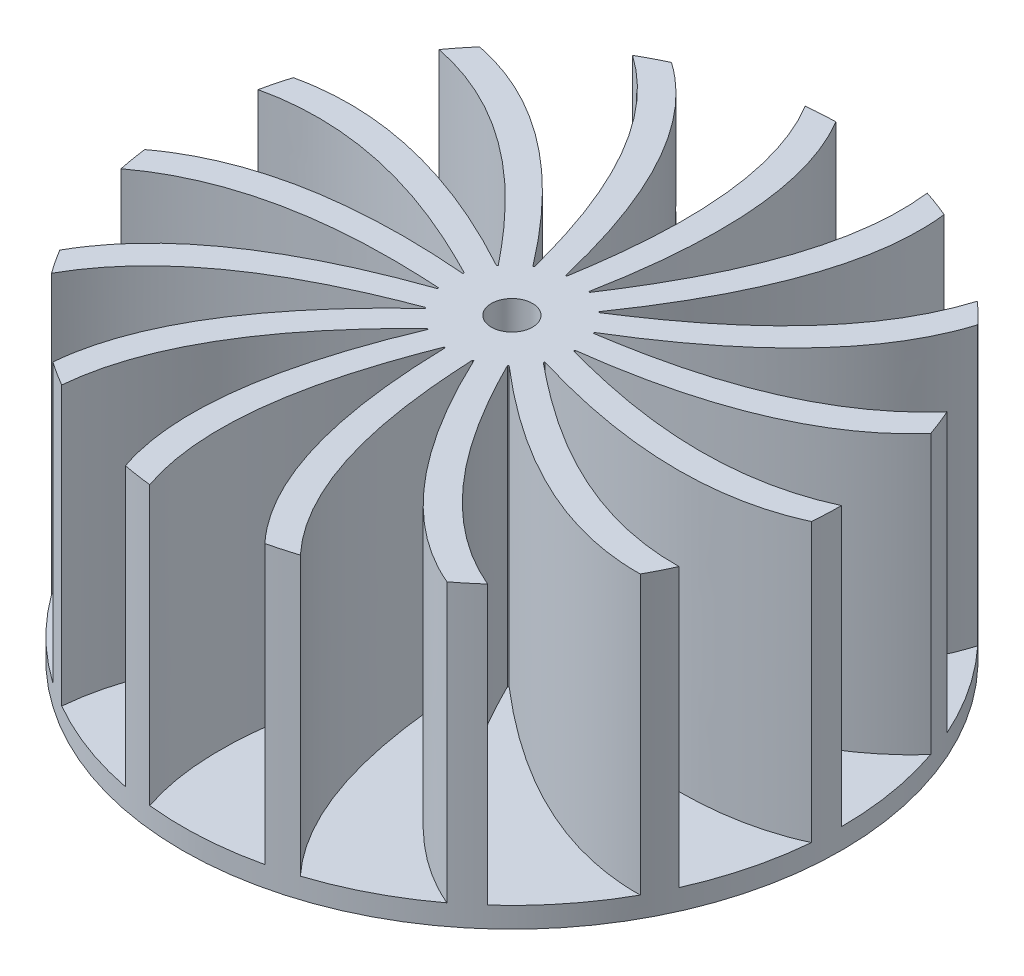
from build123d import *
from build123d.topology import SkipClean

# Parameters (mm, degrees)
SKETCH1_R               = 16
BOSS_EXTRUDE1_DEPTH     = 1
SKETCH2_R               = 3
BOSS_EXTRUDE2_DEPTH     = 13.5
BOSS_EXTRUDE3_DEPTH     = 13.5
CUT_EXTRUDE1_DEPTH      = 27.874709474
CUT_EXTRUDE1_DEPTH_BACK = 27.874709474
SKETCH5_R               = 1


with BuildPart() as part:
    # Sketch1 → Boss-Extrude1 (new body)
    with BuildSketch(Plane(origin=(0, 0, 0), x_dir=(1, 0, 0), z_dir=(0, 1, 0))):
        with Locations(Location((0, 0, 0), (0, 0, 270))):
            Circle(SKETCH1_R)
    extrude(amount=BOSS_EXTRUDE1_DEPTH)

    # Sketch2 → Boss-Extrude2 (add)
    with BuildSketch(Plane(origin=(0, 1, 0), x_dir=(1, 0, 0), z_dir=(0, 1, 0))):
        with Locations(Location((0, 0, 0), (0, 0, 270))):
            Circle(SKETCH2_R)
    extrude(amount=BOSS_EXTRUDE2_DEPTH)

    # Sketch4 → Boss-Extrude3 (add)
    with SkipClean():  # the faces are left unmerged after this step: merging them gives an invalid solid
        with BuildSketch(Plane(origin=(0, 1, 0), x_dir=(1, 0, 0), z_dir=(0, 1, 0))):
            with BuildLine():
                ThreePointArc((16, 0), (15.984664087, -0.70036707), (15.938685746, -1.399391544))
                add(Edge.make_bspline(
                    [(2.764538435, -1.16504388), (11.064438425, -3.664049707), (15.938685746, -1.399391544)],
                    knots=[0, 0, 0, 1, 1, 1], degree=2))
                ThreePointArc((2.764538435, -1.16504388), (2.940545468, -0.59429988), (3, 0))
                add(Edge.make_bspline(
                    [(3, 0), (6.042851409, -0.828316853), (11.492705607, -2.094165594), (16, 0)],
                    knots=[0, 0, 0, 0, 1, 1, 1, 1], degree=3))
            make_face()
            with BuildLine():
                ThreePointArc((2.051665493, -2.188759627), (2.444598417, -1.738947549), (2.740636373, -1.220209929))
                add(Edge.make_bspline(
                    [(2.740636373, -1.220209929), (5.183512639, -3.214554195), (9.647335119, -6.587619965), (14.616727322, -6.507786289)],
                    knots=[0, 0, 0, 0, 1, 1, 1, 1], degree=3))
                ThreePointArc((14.616727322, -6.507786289), (14.317852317, -7.141365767), (13.991530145, -7.761255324))
                add(Edge.make_bspline(
                    [(2.051665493, -2.188759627), (8.617564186, -7.847588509), (13.991530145, -7.761255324)],
                    knots=[0, 0, 0, 1, 1, 1], degree=2))
            make_face()
            with BuildLine():
                ThreePointArc((0.984040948, -2.834018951), (1.525958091, -2.582915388), (2.007391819, -2.229434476))
                add(Edge.make_bspline(
                    [(2.007391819, -2.229434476), (3.427897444, -5.044965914), (6.133852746, -9.942014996), (10.706089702, -11.890317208)],
                    knots=[0, 0, 0, 0, 1, 1, 1, 1], degree=3))
                ThreePointArc((10.706089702, -11.890317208), (10.175353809, -12.347557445), (9.625111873, -12.78112755))
                add(Edge.make_bspline(
                    [(0.984040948, -2.834018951), (4.680634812, -10.674207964), (9.625111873, -12.78112755)],
                    knots=[0, 0, 0, 1, 1, 1], degree=2))
            make_face()
            with BuildLine():
                ThreePointArc((-0.253733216, -2.989250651), (0.343465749, -2.980273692), (0.927050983, -2.853169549))
                add(Edge.make_bspline(
                    [(0.927050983, -2.853169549), (1.079567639, -6.003057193), (1.559771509, -11.577345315), (4.94427191, -15.216904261)],
                    knots=[0, 0, 0, 0, 1, 1, 1, 1], degree=3))
                ThreePointArc((4.94427191, -15.216904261), (4.273444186, -15.418744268), (3.594424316, -15.591026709))
                add(Edge.make_bspline(
                    [(-0.253733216, -2.989250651), (-0.065618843, -11.655159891), (3.594424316, -15.591026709)],
                    knots=[0, 0, 0, 1, 1, 1], degree=2))
            make_face()
            with BuildLine():
                ThreePointArc((-1.447634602, -2.627613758), (-0.898414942, -2.8623156), (-0.31358539, -2.983565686))
                add(Edge.make_bspline(
                    [(-0.31358539, -2.983565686), (-1.455429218, -5.923165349), (-3.284008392, -11.210847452), (-1.672455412, -15.912350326)],
                    knots=[0, 0, 0, 0, 1, 1, 1, 1], degree=3))
                ThreePointArc((-1.672455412, -15.912350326), (-2.367382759, -15.823890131), (-3.057771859, -15.70509571))
                add(Edge.make_bspline(
                    [(-1.447634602, -2.627613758), (-4.800526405, -10.620828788), (-3.057771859, -15.70509571)],
                    knots=[0, 0, 0, 1, 1, 1], degree=2))
            make_face()
            with BuildLine():
                ThreePointArc((-2.391226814, -1.811638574), (-1.984951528, -2.249437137), (-1.5, -2.598076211))
                add(Edge.make_bspline(
                    [(-1.5, -2.598076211), (-3.738769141, -4.819104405), (-7.559953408, -8.905892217), (-8, -13.856406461)],
                    knots=[0, 0, 0, 0, 1, 1, 1, 1], degree=3))
                ThreePointArc((-8, -13.856406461), (-8.598867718, -13.492941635), (-9.1812515, -13.103610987))
                add(Edge.make_bspline(
                    [(-2.391226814, -1.811638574), (-8.705379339, -7.750059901), (-9.1812515, -13.103610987)],
                    knots=[0, 0, 0, 1, 1, 1], degree=2))
            make_face()
            with BuildLine():
                ThreePointArc((-2.921354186, -0.682414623), (-2.728271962, -1.247610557), (-2.427050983, -1.763355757))
                add(Edge.make_bspline(
                    [(-2.427050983, -1.763355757), (-5.375641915, -2.881776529), (-10.5287138, -5.06102731), (-12.94427191, -9.404564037)],
                    knots=[0, 0, 0, 0, 1, 1, 1, 1], degree=3))
                ThreePointArc((-12.94427191, -9.404564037), (-13.343530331, -8.828940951), (-13.717209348, -8.236392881))
                add(Edge.make_bspline(
                    [(-2.921354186, -0.682414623), (-11.1049931, -3.53923525), (-13.717209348, -8.236392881)],
                    knots=[0, 0, 0, 1, 1, 1], degree=2))
            make_face()
            with BuildLine():
                ThreePointArc((-2.94635288, 0.564805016), (-2.999849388, -0.030060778), (-2.934442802, -0.623735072))
                add(Edge.make_bspline(
                    [(-2.934442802, -0.623735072), (-6.083017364, -0.446163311), (-11.676963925, -0.341064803), (-15.650361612, -3.326587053)],
                    knots=[0, 0, 0, 0, 1, 1, 1, 1], degree=3))
                ThreePointArc((-15.650361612, -3.326587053), (-15.780975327, -2.638336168), (-15.881337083, -1.945027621))
                add(Edge.make_bspline(
                    [(-2.94635288, 0.564805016), (-11.584452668, 1.283555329), (-15.881337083, -1.945027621)],
                    knots=[0, 0, 0, 1, 1, 1], degree=2))
            make_face()
            with BuildLine():
                ThreePointArc((-2.461900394, 1.714364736), (-2.752725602, 1.192686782), (-2.934442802, 0.623735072))
                add(Edge.make_bspline(
                    [(-2.934442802, 0.623735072), (-5.738583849, 2.066595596), (-10.806160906, 4.437870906), (-15.650361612, 3.326587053)],
                    knots=[0, 0, 0, 0, 1, 1, 1, 1], degree=3))
                ThreePointArc((-15.650361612, 3.326587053), (-15.489746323, 4.008460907), (-15.299437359, 4.682650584))
                add(Edge.make_bspline(
                    [(-2.461900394, 1.714364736), (-10.060855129, 5.884407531), (-15.299437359, 4.682650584)],
                    knots=[0, 0, 0, 1, 1, 1], degree=2))
            make_face()
            with BuildLine():
                ThreePointArc((-1.551762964, 2.56749522), (-2.029630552, 2.209207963), (-2.427050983, 1.763355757))
                add(Edge.make_bspline(
                    [(-2.427050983, 1.763355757), (-4.401897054, 4.222021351), (-8.066874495, 8.44945842), (-12.94427191, 9.404564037)],
                    knots=[0, 0, 0, 0, 1, 1, 1, 1], degree=3))
                ThreePointArc((-12.94427191, 9.404564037), (-12.520199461, 9.962158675), (-12.072125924, 10.500655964))
                add(Edge.make_bspline(
                    [(-1.551762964, 2.56749522), (-6.797644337, 9.467792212), (-12.072125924, 10.500655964)],
                    knots=[0, 0, 0, 1, 1, 1], degree=2))
            make_face()
            with BuildLine():
                ThreePointArc((-0.373311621, 2.976682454), (-0.95559394, 2.843737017), (-1.5, 2.598076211))
                add(Edge.make_bspline(
                    [(-1.5, 2.598076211), (-2.304082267, 5.647421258), (-3.932752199, 11.000057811), (-8, 13.856406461)],
                    knots=[0, 0, 0, 0, 1, 1, 1, 1], degree=3))
                ThreePointArc((-8, 13.856406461), (-7.385796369, 14.193308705), (-6.757434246, 14.503002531))
                add(Edge.make_bspline(
                    [(-0.373311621, 2.976682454), (-2.359059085, 11.414109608), (-6.757434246, 14.503002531)],
                    knots=[0, 0, 0, 1, 1, 1], degree=2))
            make_face()
            with BuildLine():
                ThreePointArc((0.869688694, 2.87117425), (0.283673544, 2.986558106), (-0.31358539, 2.983565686))
                add(Edge.make_bspline(
                    [(-0.31358539, 2.983565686), (0.192129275, 6.096330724), (0.88137868, 11.648647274), (-1.672455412, 15.912350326)],
                    knots=[0, 0, 0, 0, 1, 1, 1, 1], degree=3))
                ThreePointArc((-1.672455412, 15.912350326), (-0.974321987, 15.970306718), (-0.274320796, 15.997648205))
                add(Edge.make_bspline(
                    [(0.869688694, 2.87117425), (2.487428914, 11.386823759), (-0.274320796, 15.997648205)],
                    knots=[0, 0, 0, 1, 1, 1], degree=2))
            make_face()
            with BuildLine():
                ThreePointArc((1.962311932, 2.269213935), (1.473891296, 2.612976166), (0.927050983, 2.853169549))
                add(Edge.make_bspline(
                    [(0.927050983, 2.853169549), (2.65511992, 5.491129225), (5.543111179, 10.2830798), (4.94427191, 15.216904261)],
                    knots=[0, 0, 0, 0, 1, 1, 1, 1], degree=3))
                ThreePointArc((4.94427191, 15.216904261), (5.605621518, 14.985893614), (6.256225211, 14.726155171))
                add(Edge.make_bspline(
                    [(1.962311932, 2.269213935), (6.903817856, 9.390652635), (6.256225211, 14.726155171)],
                    knots=[0, 0, 0, 1, 1, 1], degree=2))
            make_face()
            with BuildLine():
                ThreePointArc((2.71563361, 1.274885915), (2.409259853, 1.78758691), (2.007391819, 2.229434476))
                add(Edge.make_bspline(
                    [(2.007391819, 2.229434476), (4.65901621, 3.936461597), (9.246389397, 7.139474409), (10.706089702, 11.890317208)],
                    knots=[0, 0, 0, 0, 1, 1, 1, 1], degree=3))
                ThreePointArc((10.706089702, 11.890317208), (11.216302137, 11.410283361), (11.705013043, 10.908376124))
                add(Edge.make_bspline(
                    [(2.71563361, 1.274885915), (10.126473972, 5.77075236), (11.705013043, 10.908376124)],
                    knots=[0, 0, 0, 1, 1, 1], degree=2))
            make_face()
            with BuildLine():
                ThreePointArc((2.999397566, 0.060118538), (2.928045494, 0.653107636), (2.740636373, 1.220209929))
                add(Edge.make_bspline(
                    [(2.740636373, 1.220209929), (5.857326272, 1.701143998), (11.350882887, 2.761389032), (14.616727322, 6.507786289)],
                    knots=[0, 0, 0, 0, 1, 1, 1, 1], degree=3))
                ThreePointArc((14.616727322, 6.507786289), (14.887582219, 5.861731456), (15.129897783, 5.204439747))
                add(Edge.make_bspline(
                    [(2.999397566, 0.060118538), (11.598170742, 1.153036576), (15.129897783, 5.204439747)],
                    knots=[0, 0, 0, 1, 1, 1], degree=2))
            make_face()
        extrude(amount=BOSS_EXTRUDE3_DEPTH)

    # Sketch5 → Cut-Extrude1 (cut, two sides: drawn at the far end of the back side and taken through both)
    with SkipClean():  # the faces are left unmerged after this step: merging them gives an invalid solid
        with BuildSketch(Plane.XZ.offset(-CUT_EXTRUDE1_DEPTH_BACK)):
            with Locations(Location((0, 0, 0), (0, 0, 270))):
                Circle(SKETCH5_R)
        extrude(amount=CUT_EXTRUDE1_DEPTH + CUT_EXTRUDE1_DEPTH_BACK, mode=Mode.SUBTRACT)


solid = part.part
